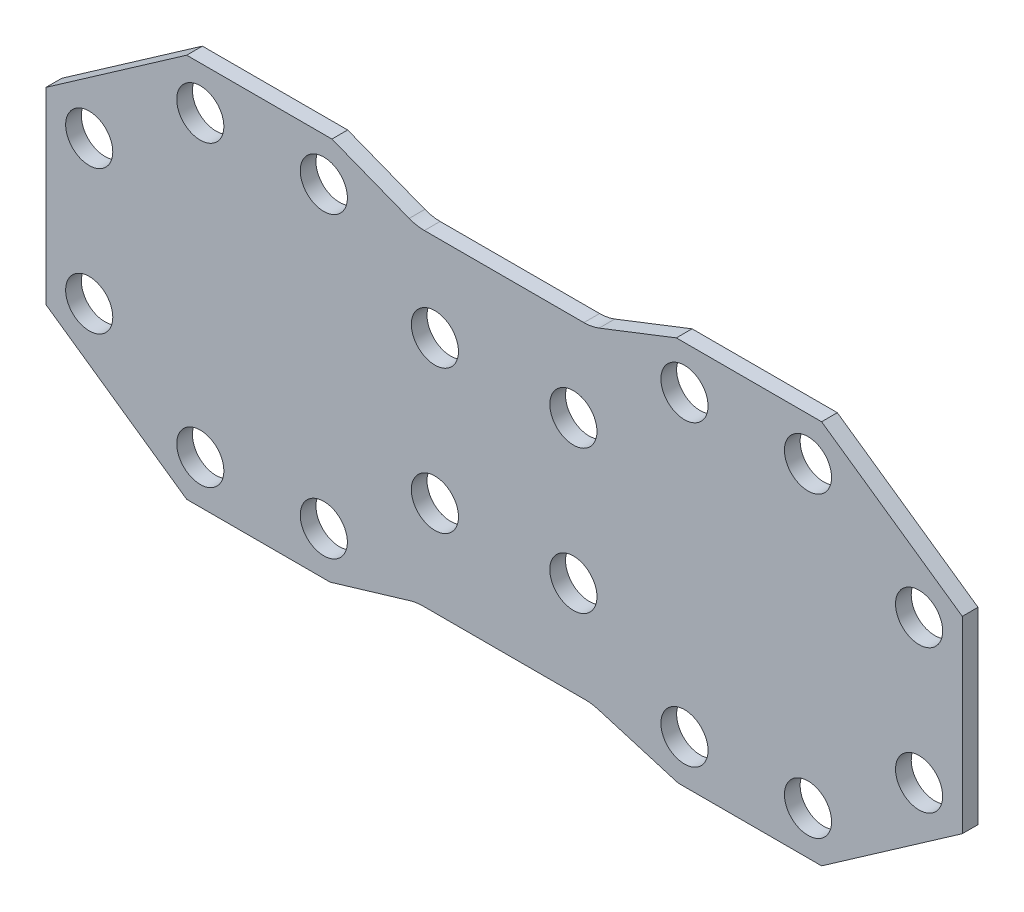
from build123d import *

# Parameters (mm, degrees)
MAIN_PLATE_DEPTH        = 38.1
CUT_EXTRUDE1_DEPTH      = 1762.130800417
CUT_EXTRUDE1_DEPTH_BACK = 1762.130800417
SKETCH5_R               = 57.15


with BuildPart() as part:
    # Sketch3 → Main Plate (new body)
    with BuildSketch(Plane(origin=(0, 0, 0), x_dir=(0, 1, 0), z_dir=(0, 0, 1))):
        with BuildLine():
            Line((466.324268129, 169.476784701), (466.324268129, -182.70492307))
            Line((466.324268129, -182.70492307), (228.234235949, -523.855268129))
            Line((228.234235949, -523.855268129), (-228.234235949, -523.855268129))
            Line((-228.234235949, -523.855268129), (-466.324268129, -182.70492307))
            Line((-466.324268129, -182.70492307), (-466.324268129, 165.037979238))
            Line((-466.324268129, 165.037979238), (-408.138164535, 360.294702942))
            ThreePointArc((-408.138164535, 360.294702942), (-404.970208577, 374.649076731), (-403.906803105, 389.310357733))
            Line((-403.906803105, 389.310357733), (-403.906803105, 784.677642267))
            ThreePointArc((-403.906803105, 784.677642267), (-404.970208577, 799.338923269), (-408.138164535, 813.693297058))
            Line((-408.138164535, 813.693297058), (-466.324268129, 1008.950020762))
            Line((-466.324268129, 1008.950020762), (-466.324268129, 1356.69292307))
            Line((-466.324268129, 1356.69292307), (-228.234235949, 1697.843268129))
            Line((-228.234235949, 1697.843268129), (228.234235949, 1697.843268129))
            Line((228.234235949, 1697.843268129), (466.324268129, 1356.69292307))
            Line((466.324268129, 1356.69292307), (466.324268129, 1004.511215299))
            Line((466.324268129, 1004.511215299), (393.274931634, 817.306570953))
            ThreePointArc((393.274931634, 817.306570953), (388.077053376, 799.164133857), (386.324268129, 780.37334606))
            Line((386.324268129, 780.37334606), (386.324268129, 393.61465394))
            ThreePointArc((386.324268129, 393.61465394), (388.077053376, 374.823866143), (393.274931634, 356.681429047))
            Line((393.274931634, 356.681429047), (466.324268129, 169.476784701))
        make_face()
    extrude(amount=MAIN_PLATE_DEPTH)

    # Sketch5 → Cut-Extrude1 (cut, two sides: drawn at the far end of the back side and taken through both)
    with BuildSketch(Plane(origin=(0, 0, 0), x_dir=(0, 1, 0), z_dir=(0, 0, 1)).offset(-CUT_EXTRUDE1_DEPTH_BACK)):
        with Locations(Location((-173.588730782, 419.080268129, 0), (0, 0, 270))):
            Circle(SKETCH5_R)
        with Locations(Location((173.588730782, 419.080268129, 0), (0, 0, 270))):
            Circle(SKETCH5_R)
        with Locations(Location((361.549268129, 149.758610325, 0), (0, 0, 270))):
            Circle(SKETCH5_R)
        with Locations(Location((361.549268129, -149.758610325, 0), (0, 0, 270))):
            Circle(SKETCH5_R)
        with Locations(Location((173.588730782, -419.080268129, 0), (0, 0, 270))):
            Circle(SKETCH5_R)
        with Locations(Location((-173.588730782, -419.080268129, 0), (0, 0, 270))):
            Circle(SKETCH5_R)
        with Locations(Location((-361.549268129, -149.758610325, 0), (0, 0, 270))):
            Circle(SKETCH5_R)
        with Locations(Location((-361.549268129, 149.758610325, 0), (0, 0, 270))):
            Circle(SKETCH5_R)
        with Locations(Location((173.588730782, 1593.068268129, 0), (0, 0, 270))):
            Circle(SKETCH5_R)
        with Locations(Location((-361.549268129, 1024.229389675, 0), (0, 0, 270))):
            Circle(SKETCH5_R)
        with Locations(Location((173.588730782, 754.907731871, 0), (0, 0, 270))):
            Circle(SKETCH5_R)
        with Locations(Location((-173.588730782, 754.907731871, 0), (0, 0, 270))):
            Circle(SKETCH5_R)
        with Locations(Location((-173.588730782, 1593.068268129, 0), (0, 0, 270))):
            Circle(SKETCH5_R)
        with Locations(Location((-361.549268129, 1323.746610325, 0), (0, 0, 270))):
            Circle(SKETCH5_R)
        with Locations(Location((361.549268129, 1024.229389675, 0), (0, 0, 270))):
            Circle(SKETCH5_R)
        with Locations(Location((361.549268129, 1323.746610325, 0), (0, 0, 270))):
            Circle(SKETCH5_R)
    extrude(amount=CUT_EXTRUDE1_DEPTH + CUT_EXTRUDE1_DEPTH_BACK, mode=Mode.SUBTRACT)


solid = part.part
